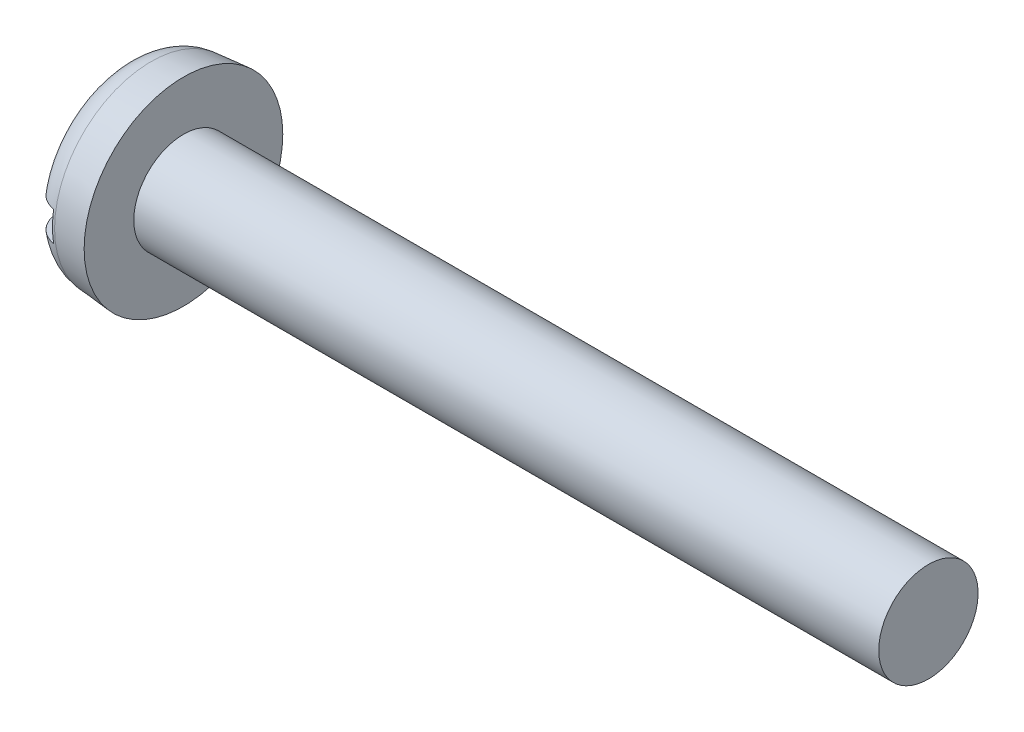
ISO-10303-21;
HEADER;
FILE_DESCRIPTION(('STEP AP214'),'2;1');
FILE_NAME('part.step','',(''),(''),'','','');
FILE_SCHEMA(('AUTOMOTIVE_DESIGN { 1 0 10303 214 1 1 1 1 }'));
ENDSEC;
DATA;
#1=APPLICATION_CONTEXT('core data for automotive mechanical design processes');
#2=APPLICATION_PROTOCOL_DEFINITION('international standard','automotive_design',2000,#1);
#3=PRODUCT_CONTEXT('',#1,'mechanical');
#4=PRODUCT('Part','Part','',(#3));
#5=PRODUCT_RELATED_PRODUCT_CATEGORY('part','',(#4));
#6=PRODUCT_DEFINITION_FORMATION('','',#4);
#7=PRODUCT_DEFINITION_CONTEXT('part definition',#1,'design');
#8=PRODUCT_DEFINITION('design','',#6,#7);
#9=PRODUCT_DEFINITION_SHAPE('','',#8);
#10=(LENGTH_UNIT() NAMED_UNIT(*) SI_UNIT(.MILLI.,.METRE.));
#11=(NAMED_UNIT(*) PLANE_ANGLE_UNIT() SI_UNIT($,.RADIAN.));
#12=(NAMED_UNIT(*) SI_UNIT($,.STERADIAN.) SOLID_ANGLE_UNIT());
#13=UNCERTAINTY_MEASURE_WITH_UNIT(LENGTH_MEASURE(1.E-05),#10,'distance_accuracy_value','');
#14=(GEOMETRIC_REPRESENTATION_CONTEXT(3) GLOBAL_UNCERTAINTY_ASSIGNED_CONTEXT((#13)) GLOBAL_UNIT_ASSIGNED_CONTEXT((#10,
#11,#12)) REPRESENTATION_CONTEXT('',''));
#15=CARTESIAN_POINT('',(0.,0.,0.));
#16=DIRECTION('',(0.,0.,1.));
#17=DIRECTION('',(1.,0.,0.));
#18=AXIS2_PLACEMENT_3D('',#15,#16,#17);
#19=CARTESIAN_POINT('',(0.,0.,0.));
#20=DIRECTION('',(-1.,0.,0.));
#21=DIRECTION('',(0.,0.,1.));
#22=AXIS2_PLACEMENT_3D('',#19,#20,#21);
#23=PLANE('',#22);
#24=DIRECTION('',(0.,0.,-1.));
#25=VECTOR('',#24,1.);
#26=CARTESIAN_POINT('',(0.,0.599999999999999,4.));
#27=LINE('',#26,#25);
#28=CARTESIAN_POINT('',(0.,0.599999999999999,2.62267277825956));
#29=VERTEX_POINT('',#28);
#30=CARTESIAN_POINT('',(0.,0.599999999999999,-2.62267277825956));
#31=VERTEX_POINT('',#30);
#32=EDGE_CURVE('E85',#29,#31,#27,.T.);
#33=ORIENTED_EDGE('',*,*,#32,.F.);
#34=CARTESIAN_POINT('',(0.,0.,0.));
#35=DIRECTION('',(-1.,0.,0.));
#36=DIRECTION('',(0.,0.,1.));
#37=AXIS2_PLACEMENT_3D('',#34,#35,#36);
#38=CIRCLE('',#37,2.69042979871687);
#39=EDGE_CURVE('E91',#29,#31,#38,.T.);
#40=ORIENTED_EDGE('',*,*,#39,.T.);
#41=EDGE_LOOP('',(#33,#40));
#42=FACE_BOUND('',#41,.T.);
#43=ADVANCED_FACE('F32',(#42),#23,.T.);
#44=CARTESIAN_POINT('',(-25.4,0.,0.));
#45=DIRECTION('',(-1.,0.,0.));
#46=DIRECTION('',(0.,0.,1.));
#47=AXIS2_PLACEMENT_3D('',#44,#45,#46);
#48=CYLINDRICAL_SURFACE('',#47,2.);
#49=CARTESIAN_POINT('',(32.4,0.,0.));
#50=DIRECTION('',(-1.,0.,0.));
#51=DIRECTION('',(0.,0.,1.));
#52=AXIS2_PLACEMENT_3D('',#49,#50,#51);
#53=CIRCLE('',#52,2.);
#54=CARTESIAN_POINT('',(32.4,0.,2.));
#55=VERTEX_POINT('',#54);
#56=EDGE_CURVE('E92',#55,#55,#53,.T.);
#57=ORIENTED_EDGE('',*,*,#56,.T.);
#58=EDGE_LOOP('',(#57));
#59=FACE_BOUND('',#58,.T.);
#60=CARTESIAN_POINT('',(2.4,0.,0.));
#61=DIRECTION('',(-1.,0.,0.));
#62=DIRECTION('',(0.,0.,1.));
#63=AXIS2_PLACEMENT_3D('',#60,#61,#62);
#64=CIRCLE('',#63,2.);
#65=CARTESIAN_POINT('',(2.4,0.,2.));
#66=VERTEX_POINT('',#65);
#67=EDGE_CURVE('E149',#66,#66,#64,.T.);
#68=ORIENTED_EDGE('',*,*,#67,.F.);
#69=EDGE_LOOP('',(#68));
#70=FACE_BOUND('',#69,.T.);
#71=ADVANCED_FACE('F137',(#59,#70),#48,.T.);
#72=CARTESIAN_POINT('',(32.4,2.,0.));
#73=DIRECTION('',(1.,0.,0.));
#74=DIRECTION('',(0.,0.,-1.));
#75=AXIS2_PLACEMENT_3D('',#72,#73,#74);
#76=PLANE('',#75);
#77=ORIENTED_EDGE('',*,*,#56,.F.);
#78=EDGE_LOOP('',(#77));
#79=FACE_BOUND('',#78,.T.);
#80=ADVANCED_FACE('F135',(#79),#76,.T.);
#81=DIRECTION('',(0.,0.,1.));
#82=VECTOR('',#81,1.);
#83=CARTESIAN_POINT('',(0.,-0.599999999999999,-4.));
#84=LINE('',#83,#82);
#85=CARTESIAN_POINT('',(0.,-0.6,-2.62267277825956));
#86=VERTEX_POINT('',#85);
#87=CARTESIAN_POINT('',(0.,-0.6,2.62267277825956));
#88=VERTEX_POINT('',#87);
#89=EDGE_CURVE('E76',#86,#88,#84,.T.);
#90=ORIENTED_EDGE('',*,*,#89,.F.);
#91=EDGE_CURVE('E83',#86,#88,#38,.T.);
#92=ORIENTED_EDGE('',*,*,#91,.T.);
#93=EDGE_LOOP('',(#90,#92));
#94=FACE_BOUND('',#93,.T.);
#95=ADVANCED_FACE('F82',(#94),#23,.T.);
#96=CARTESIAN_POINT('',(0.,0.,0.));
#97=DIRECTION('',(1.,0.,0.));
#98=DIRECTION('',(0.,0.,-1.));
#99=AXIS2_PLACEMENT_3D('',#96,#97,#98);
#100=CONICAL_SURFACE('',#99,3.79002720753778,0.0872664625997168);
#101=CARTESIAN_POINT('',(1.09541310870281,0.,0.));
#102=DIRECTION('',(-1.,0.,0.));
#103=DIRECTION('',(0.,0.,1.));
#104=AXIS2_PLACEMENT_3D('',#101,#102,#103);
#105=CIRCLE('',#104,3.88586343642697);
#106=CARTESIAN_POINT('',(1.09541310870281,0.,3.88586343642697));
#107=VERTEX_POINT('',#106);
#108=EDGE_CURVE('E95',#107,#107,#105,.F.);
#109=ORIENTED_EDGE('',*,*,#108,.T.);
#110=EDGE_LOOP('',(#109));
#111=FACE_BOUND('',#110,.T.);
#112=CARTESIAN_POINT('',(2.4,0.,0.));
#113=DIRECTION('',(-1.,0.,0.));
#114=DIRECTION('',(0.,0.,1.));
#115=AXIS2_PLACEMENT_3D('',#112,#113,#114);
#116=CIRCLE('',#115,4.);
#117=CARTESIAN_POINT('',(2.4,0.,4.));
#118=VERTEX_POINT('',#117);
#119=EDGE_CURVE('E97',#118,#118,#116,.T.);
#120=ORIENTED_EDGE('',*,*,#119,.T.);
#121=EDGE_LOOP('',(#120));
#122=FACE_BOUND('',#121,.T.);
#123=ADVANCED_FACE('F128',(#111,#122),#100,.T.);
#124=CARTESIAN_POINT('',(2.4,2.,0.));
#125=DIRECTION('',(-1.,0.,0.));
#126=DIRECTION('',(0.,0.,1.));
#127=AXIS2_PLACEMENT_3D('',#124,#125,#126);
#128=PLANE('',#127);
#129=ORIENTED_EDGE('',*,*,#119,.F.);
#130=EDGE_LOOP('',(#129));
#131=FACE_BOUND('',#130,.T.);
#132=ORIENTED_EDGE('',*,*,#67,.T.);
#133=EDGE_LOOP('',(#132));
#134=FACE_BOUND('',#133,.T.);
#135=ADVANCED_FACE('F124',(#131,#134),#128,.F.);
#136=CARTESIAN_POINT('',(1.2,0.,0.));
#137=DIRECTION('',(-1.,0.,0.));
#138=DIRECTION('',(0.,0.,1.));
#139=AXIS2_PLACEMENT_3D('',#136,#137,#138);
#140=TOROIDAL_SURFACE('',#139,2.69042979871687,1.2);
#141=CARTESIAN_POINT('',(0.3865043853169,0.599999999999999,-3.52185650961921));
#142=CARTESIAN_POINT('',(0.435468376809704,0.599999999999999,-3.56765543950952));
#143=CARTESIAN_POINT('',(0.48830443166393,0.599999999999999,-3.60938194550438));
#144=CARTESIAN_POINT('',(0.600265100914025,0.599999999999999,-3.68342203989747));
#145=CARTESIAN_POINT('',(0.659396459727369,0.599999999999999,-3.71572539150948));
#146=CARTESIAN_POINT('',(0.782252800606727,0.599999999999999,-3.76991557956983));
#147=CARTESIAN_POINT('',(0.845977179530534,0.599999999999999,-3.79180378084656));
#148=CARTESIAN_POINT('',(0.976191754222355,0.599999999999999,-3.82450279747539));
#149=CARTESIAN_POINT('',(1.04268130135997,0.599999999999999,-3.83531619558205));
#150=CARTESIAN_POINT('',(1.1761990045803,0.599999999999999,-3.84552483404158));
#151=CARTESIAN_POINT('',(1.2432228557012,0.599999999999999,-3.84497642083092));
#152=CARTESIAN_POINT('',(1.37622462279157,0.599999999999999,-3.83261582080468));
#153=CARTESIAN_POINT('',(1.44220252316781,0.599999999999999,-3.82080346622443));
#154=CARTESIAN_POINT('',(1.57113854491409,0.599999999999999,-3.7862937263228));
#155=CARTESIAN_POINT('',(1.63410108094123,0.599999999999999,-3.76361282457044));
#156=CARTESIAN_POINT('',(1.75534617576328,0.599999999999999,-3.70804459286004));
#157=CARTESIAN_POINT('',(1.81362870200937,0.599999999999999,-3.67515719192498));
#158=CARTESIAN_POINT('',(1.92413366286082,0.599999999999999,-3.5999836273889));
#159=CARTESIAN_POINT('',(1.97632984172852,0.599999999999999,-3.55765888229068));
#160=CARTESIAN_POINT('',(2.07296076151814,0.599999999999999,-3.46492588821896));
#161=CARTESIAN_POINT('',(2.11739523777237,0.599999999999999,-3.4145173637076));
#162=CARTESIAN_POINT('',(2.19773705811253,0.599999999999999,-3.30652404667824));
#163=CARTESIAN_POINT('',(2.2335546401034,0.599999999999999,-3.24887250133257));
#164=CARTESIAN_POINT('',(2.29517588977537,0.599999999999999,-3.12844912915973));
#165=CARTESIAN_POINT('',(2.32097889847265,0.599999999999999,-3.06567696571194));
#166=CARTESIAN_POINT('',(2.36230436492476,0.599999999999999,-2.93572304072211));
#167=CARTESIAN_POINT('',(2.37765465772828,0.599999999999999,-2.86848656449));
#168=CARTESIAN_POINT('',(2.39710654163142,0.599999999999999,-2.73240889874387));
#169=CARTESIAN_POINT('',(2.40120699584,0.599999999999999,-2.66356754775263));
#170=CARTESIAN_POINT('',(2.39814758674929,0.599999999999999,-2.52464946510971));
#171=CARTESIAN_POINT('',(2.39074269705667,0.599999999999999,-2.45457815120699));
#172=CARTESIAN_POINT('',(2.36454808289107,0.599999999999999,-2.31659764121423));
#173=CARTESIAN_POINT('',(2.34575688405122,0.599999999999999,-2.24868872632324));
#174=CARTESIAN_POINT('',(2.29682890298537,0.599999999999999,-2.11531585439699));
#175=CARTESIAN_POINT('',(2.26644200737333,0.599999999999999,-2.04994358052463));
#176=CARTESIAN_POINT('',(2.19524076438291,0.599999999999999,-1.92513363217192));
#177=CARTESIAN_POINT('',(2.15442449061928,0.599999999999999,-1.86569705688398));
#178=CARTESIAN_POINT('',(2.06294283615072,0.599999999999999,-1.75389115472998));
#179=CARTESIAN_POINT('',(2.01217853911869,0.599999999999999,-1.70160258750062));
#180=CARTESIAN_POINT('',(1.90235992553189,0.599999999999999,-1.60657192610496));
#181=CARTESIAN_POINT('',(1.84330597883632,0.599999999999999,-1.56382940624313));
#182=CARTESIAN_POINT('',(1.72028944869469,0.599999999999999,-1.49071034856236));
#183=CARTESIAN_POINT('',(1.65652070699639,0.599999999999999,-1.46000898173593));
#184=CARTESIAN_POINT('',(1.52445964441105,0.599999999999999,-1.41076217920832));
#185=CARTESIAN_POINT('',(1.45617085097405,0.599999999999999,-1.39220738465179));
#186=CARTESIAN_POINT('',(1.32258878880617,0.599999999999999,-1.3692588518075));
#187=CARTESIAN_POINT('',(1.25746124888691,0.599999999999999,-1.36389765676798));
#188=CARTESIAN_POINT('',(1.12729576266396,0.599999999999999,-1.36480396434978));
#189=CARTESIAN_POINT('',(1.06225779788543,0.599999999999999,-1.37106853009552));
#190=CARTESIAN_POINT('',(0.937361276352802,0.599999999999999,-1.39427975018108));
#191=CARTESIAN_POINT('',(0.877403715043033,0.599999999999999,-1.41070181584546));
#192=CARTESIAN_POINT('',(0.760914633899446,0.599999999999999,-1.45296891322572));
#193=CARTESIAN_POINT('',(0.704383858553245,0.599999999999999,-1.47881598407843));
#194=CARTESIAN_POINT('',(0.59370506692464,0.599999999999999,-1.54020998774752));
#195=CARTESIAN_POINT('',(0.539760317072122,0.599999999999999,-1.57612236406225));
#196=CARTESIAN_POINT('',(0.438104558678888,0.599999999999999,-1.65588570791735));
#197=CARTESIAN_POINT('',(0.390395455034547,0.599999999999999,-1.69973909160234));
#198=CARTESIAN_POINT('',(0.298820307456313,0.599999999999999,-1.79776253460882));
#199=CARTESIAN_POINT('',(0.255521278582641,0.599999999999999,-1.85246315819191));
#200=CARTESIAN_POINT('',(0.178283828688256,0.599999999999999,-1.96812037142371));
#201=CARTESIAN_POINT('',(0.144347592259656,0.599999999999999,-2.02907841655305));
#202=CARTESIAN_POINT('',(0.0855336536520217,0.599999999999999,-2.15824220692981));
#203=CARTESIAN_POINT('',(0.0610804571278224,0.599999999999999,-2.22664188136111));
#204=CARTESIAN_POINT('',(0.0240295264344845,0.599999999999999,-2.36658228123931));
#205=CARTESIAN_POINT('',(0.0114315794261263,0.599999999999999,-2.43812295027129));
#206=CARTESIAN_POINT('',(-0.00140349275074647,0.599999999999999,-2.58214276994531));
#207=CARTESIAN_POINT('',(-0.00166960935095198,0.599999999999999,-2.65461931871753));
#208=CARTESIAN_POINT('',(0.0102529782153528,0.599999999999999,-2.79856484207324));
#209=CARTESIAN_POINT('',(0.0224436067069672,0.599999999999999,-2.87003365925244));
#210=CARTESIAN_POINT('',(0.0586721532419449,0.599999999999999,-3.00828260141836));
#211=CARTESIAN_POINT('',(0.082454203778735,0.599999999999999,-3.07512990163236));
#212=CARTESIAN_POINT('',(0.141152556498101,0.599999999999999,-3.20367573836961));
#213=CARTESIAN_POINT('',(0.176053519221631,0.599999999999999,-3.26538122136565));
#214=CARTESIAN_POINT('',(0.240740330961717,0.599999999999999,-3.35956174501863));
#215=CARTESIAN_POINT('',(0.267410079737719,0.599999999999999,-3.39421743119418));
#216=CARTESIAN_POINT('',(0.324340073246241,0.599999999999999,-3.46044388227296));
#217=CARTESIAN_POINT('',(0.354600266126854,0.599999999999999,-3.49201469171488));
#218=CARTESIAN_POINT('',(0.3865043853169,0.599999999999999,-3.52185650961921));
#219=B_SPLINE_CURVE_WITH_KNOTS('',3,(#141,#142,#143,#144,#145,#146,#147,#148,#149,#150,#151,
#152,#153,#154,#155,#156,#157,#158,#159,#160,#161,#162,#163,#164,#165,#166,#167,#168,#169,#170,
#171,#172,#173,#174,#175,#176,#177,#178,#179,#180,#181,#182,#183,#184,#185,#186,#187,#188,#189,
#190,#191,#192,#193,#194,#195,#196,#197,#198,#199,#200,#201,#202,#203,#204,#205,#206,#207,#208,
#209,#210,#211,#212,#213,#214,#215,#216,#217,#218),.UNSPECIFIED.,.T.,.F.,(4,2,2,2,2,2,2,2,2,2,2,
2,2,2,2,2,2,2,2,2,2,2,2,2,2,2,2,2,2,2,2,2,2,2,2,2,2,2,4),(0.,0.200976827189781,
0.402171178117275,0.603339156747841,0.804460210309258,1.0045840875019,1.2047109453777,
1.40453524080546,1.60436092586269,1.80501901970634,2.00568395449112,2.2083565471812,
2.41104247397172,2.61699090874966,2.82296015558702,3.03337636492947,3.24381982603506,
3.45908552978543,3.67439102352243,3.8919572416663,4.10951375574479,4.32071351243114,
4.53175034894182,4.72677835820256,4.92175710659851,5.10742155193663,5.29312619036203,
5.48672044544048,5.68037370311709,5.88873369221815,6.09714225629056,6.31402614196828,
6.53090613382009,6.74727622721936,6.96367975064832,7.17550906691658,7.38704740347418,
7.51800243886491,7.64895558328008),.UNSPECIFIED.);
#220=CARTESIAN_POINT('',(1.,0.599999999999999,-3.8268957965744));
#221=VERTEX_POINT('',#220);
#222=EDGE_CURVE('E11',#31,#221,#219,.T.);
#223=ORIENTED_EDGE('',*,*,#222,.F.);
#224=ORIENTED_EDGE('',*,*,#39,.F.);
#225=CARTESIAN_POINT('',(0.568676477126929,0.599999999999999,1.55841219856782));
#226=CARTESIAN_POINT('',(0.622454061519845,0.599999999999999,1.52276443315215));
#227=CARTESIAN_POINT('',(0.679085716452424,0.599999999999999,1.49137245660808));
#228=CARTESIAN_POINT('',(0.796770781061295,0.599999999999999,1.43831139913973));
#229=CARTESIAN_POINT('',(0.857825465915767,0.599999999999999,1.41664513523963));
#230=CARTESIAN_POINT('',(0.982921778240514,0.599999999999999,1.38402811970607));
#231=CARTESIAN_POINT('',(1.04697051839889,0.599999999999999,1.37310440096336));
#232=CARTESIAN_POINT('',(1.17597937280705,0.599999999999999,1.36268675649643));
#233=CARTESIAN_POINT('',(1.24093916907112,0.599999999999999,1.36318893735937));
#234=CARTESIAN_POINT('',(1.36722529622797,0.599999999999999,1.37533615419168));
#235=CARTESIAN_POINT('',(1.42859438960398,0.599999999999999,1.38654477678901));
#236=CARTESIAN_POINT('',(1.54865022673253,0.599999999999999,1.41889802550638));
#237=CARTESIAN_POINT('',(1.60733638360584,0.599999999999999,1.44004481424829));
#238=CARTESIAN_POINT('',(1.72180457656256,0.599999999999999,1.49189888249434));
#239=CARTESIAN_POINT('',(1.77749881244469,0.599999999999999,1.52279911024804));
#240=CARTESIAN_POINT('',(1.88340638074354,0.599999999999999,1.59287167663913));
#241=CARTESIAN_POINT('',(1.93361816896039,0.599999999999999,1.63204633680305));
#242=CARTESIAN_POINT('',(2.03113053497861,0.599999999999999,1.7207614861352));
#243=CARTESIAN_POINT('',(2.07792119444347,0.599999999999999,1.77086293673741));
#244=CARTESIAN_POINT('',(2.16295007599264,0.599999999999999,1.87786529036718));
#245=CARTESIAN_POINT('',(2.20118595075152,0.599999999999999,1.93476805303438));
#246=CARTESIAN_POINT('',(2.26997158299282,0.599999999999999,2.05705672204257));
#247=CARTESIAN_POINT('',(2.30000838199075,0.599999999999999,2.12273201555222));
#248=CARTESIAN_POINT('',(2.34872218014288,0.599999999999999,2.25817360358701));
#249=CARTESIAN_POINT('',(2.36739836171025,0.599999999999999,2.32794019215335));
#250=CARTESIAN_POINT('',(2.39284815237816,0.599999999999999,2.47012141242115));
#251=CARTESIAN_POINT('',(2.3995382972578,0.599999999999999,2.54255105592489));
#252=CARTESIAN_POINT('',(2.40041533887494,0.599999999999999,2.68749005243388));
#253=CARTESIAN_POINT('',(2.39460324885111,0.599999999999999,2.75999939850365));
#254=CARTESIAN_POINT('',(2.37072428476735,0.599999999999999,2.90156578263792));
#255=CARTESIAN_POINT('',(2.35289092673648,0.599999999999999,2.97066215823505));
#256=CARTESIAN_POINT('',(2.3055955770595,0.599999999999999,3.10475609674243));
#257=CARTESIAN_POINT('',(2.2761350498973,0.599999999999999,3.16975417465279));
#258=CARTESIAN_POINT('',(2.20718370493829,0.599999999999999,3.29217559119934));
#259=CARTESIAN_POINT('',(2.16794580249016,0.599999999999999,3.34974141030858));
#260=CARTESIAN_POINT('',(2.08018656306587,0.599999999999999,3.45730019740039));
#261=CARTESIAN_POINT('',(2.03166624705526,0.599999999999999,3.50729399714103));
#262=CARTESIAN_POINT('',(1.92773605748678,0.599999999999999,3.59728886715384));
#263=CARTESIAN_POINT('',(1.87247613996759,0.599999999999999,3.63746317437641));
#264=CARTESIAN_POINT('',(1.75592540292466,0.599999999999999,3.70782235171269));
#265=CARTESIAN_POINT('',(1.69463504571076,0.599999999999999,3.73800798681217));
#266=CARTESIAN_POINT('',(1.5686108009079,0.599999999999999,3.78714975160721));
#267=CARTESIAN_POINT('',(1.50393088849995,0.599999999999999,3.80624437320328));
#268=CARTESIAN_POINT('',(1.37227430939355,0.599999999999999,3.83322369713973));
#269=CARTESIAN_POINT('',(1.30529774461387,0.599999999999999,3.84110889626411));
#270=CARTESIAN_POINT('',(1.17141837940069,0.599999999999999,3.845417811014));
#271=CARTESIAN_POINT('',(1.10451797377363,0.599999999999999,3.841916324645));
#272=CARTESIAN_POINT('',(0.972258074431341,0.599999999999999,3.82372114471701));
#273=CARTESIAN_POINT('',(0.906898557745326,0.599999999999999,3.80902761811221));
#274=CARTESIAN_POINT('',(0.779620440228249,0.599999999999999,3.76890152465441));
#275=CARTESIAN_POINT('',(0.717699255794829,0.599999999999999,3.74347714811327));
#276=CARTESIAN_POINT('',(0.598976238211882,0.599999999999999,3.68264222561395));
#277=CARTESIAN_POINT('',(0.542174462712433,0.599999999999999,3.64723156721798));
#278=CARTESIAN_POINT('',(0.434989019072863,0.599999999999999,3.56726339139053));
#279=CARTESIAN_POINT('',(0.384638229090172,0.599999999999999,3.5226618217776));
#280=CARTESIAN_POINT('',(0.292043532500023,0.599999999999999,3.42571932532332));
#281=CARTESIAN_POINT('',(0.249799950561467,0.599999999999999,3.37337808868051));
#282=CARTESIAN_POINT('',(0.174110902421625,0.599999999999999,3.26185326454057));
#283=CARTESIAN_POINT('',(0.140765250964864,0.599999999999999,3.20260196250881));
#284=CARTESIAN_POINT('',(0.0843091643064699,0.599999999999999,3.07941230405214));
#285=CARTESIAN_POINT('',(0.0611994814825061,0.599999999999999,3.01547360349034));
#286=CARTESIAN_POINT('',(0.0254327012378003,0.599999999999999,2.88357716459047));
#287=CARTESIAN_POINT('',(0.0129588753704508,0.599999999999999,2.81556976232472));
#288=CARTESIAN_POINT('',(-0.000658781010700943,0.599999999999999,2.67843562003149));
#289=CARTESIAN_POINT('',(-0.00180186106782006,0.599999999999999,2.60930880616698));
#290=CARTESIAN_POINT('',(0.00723867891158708,0.599999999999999,2.47027110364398));
#291=CARTESIAN_POINT('',(0.0176724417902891,0.599999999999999,2.40037650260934));
#292=CARTESIAN_POINT('',(0.0498636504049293,0.599999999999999,2.2632278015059));
#293=CARTESIAN_POINT('',(0.0716251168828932,0.599999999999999,2.19597464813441));
#294=CARTESIAN_POINT('',(0.126425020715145,0.599999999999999,2.06442921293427));
#295=CARTESIAN_POINT('',(0.159709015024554,0.599999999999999,2.00023925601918));
#296=CARTESIAN_POINT('',(0.236484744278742,0.599999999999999,1.87833288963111));
#297=CARTESIAN_POINT('',(0.279968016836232,0.599999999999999,1.82061117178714));
#298=CARTESIAN_POINT('',(0.363480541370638,0.599999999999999,1.7273106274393));
#299=CARTESIAN_POINT('',(0.401461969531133,0.599999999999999,1.68987927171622));
#300=CARTESIAN_POINT('',(0.481873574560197,0.599999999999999,1.62013708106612));
#301=CARTESIAN_POINT('',(0.524303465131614,0.599999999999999,1.58782591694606));
#302=CARTESIAN_POINT('',(0.568676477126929,0.599999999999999,1.55841219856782));
#303=B_SPLINE_CURVE_WITH_KNOTS('',3,(#225,#226,#227,#228,#229,#230,#231,#232,#233,#234,#235,
#236,#237,#238,#239,#240,#241,#242,#243,#244,#245,#246,#247,#248,#249,#250,#251,#252,#253,#254,
#255,#256,#257,#258,#259,#260,#261,#262,#263,#264,#265,#266,#267,#268,#269,#270,#271,#272,#273,
#274,#275,#276,#277,#278,#279,#280,#281,#282,#283,#284,#285,#286,#287,#288,#289,#290,#291,#292,
#293,#294,#295,#296,#297,#298,#299,#300,#301,#302),.UNSPECIFIED.,.T.,.F.,(4,2,2,2,2,2,2,2,2,2,2,
2,2,2,2,2,2,2,2,2,2,2,2,2,2,2,2,2,2,2,2,2,2,2,2,2,2,2,4),(0.,0.193385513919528,
0.386827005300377,0.580754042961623,0.774615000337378,0.960896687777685,1.14721893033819,
1.33748625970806,1.52780704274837,1.73256769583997,1.93738446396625,2.15302491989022,
2.3686808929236,2.58583282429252,2.80296715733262,3.01600070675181,3.22900743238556,
3.43699107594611,3.64495185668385,3.84892478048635,4.05288207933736,4.25423457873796,
4.45557815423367,4.65560180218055,4.85562246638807,5.05549074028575,5.25536126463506,
5.45621303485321,5.6570728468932,5.86009921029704,6.06314049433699,6.26961358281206,
6.47610034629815,6.68713711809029,6.89824884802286,7.11416888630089,7.3299104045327,
7.4894871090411,7.64905354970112),.UNSPECIFIED.);
#304=CARTESIAN_POINT('',(1.,0.599999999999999,3.8268957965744));
#305=VERTEX_POINT('',#304);
#306=EDGE_CURVE('E109',#305,#29,#303,.T.);
#307=ORIENTED_EDGE('',*,*,#306,.F.);
#308=CARTESIAN_POINT('',(1.,0.,0.));
#309=DIRECTION('',(-1.,0.,0.));
#310=DIRECTION('',(0.,0.,1.));
#311=AXIS2_PLACEMENT_3D('',#308,#309,#310);
#312=CIRCLE('',#311,3.8736457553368);
#313=CARTESIAN_POINT('',(1.,-0.600000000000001,3.8268957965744));
#314=VERTEX_POINT('',#313);
#315=EDGE_CURVE('E103',#305,#314,#312,.F.);
#316=ORIENTED_EDGE('',*,*,#315,.T.);
#317=CARTESIAN_POINT('',(0.568676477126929,-0.6,1.55841219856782));
#318=CARTESIAN_POINT('',(0.509332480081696,-0.6,1.59775463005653));
#319=CARTESIAN_POINT('',(0.453379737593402,-0.6,1.64234041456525));
#320=CARTESIAN_POINT('',(0.349719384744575,-0.6,1.74035526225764));
#321=CARTESIAN_POINT('',(0.302029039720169,-0.6,1.79380239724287));
#322=CARTESIAN_POINT('',(0.216237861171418,-0.6,1.90774469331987));
#323=CARTESIAN_POINT('',(0.178118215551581,-0.6,1.96822568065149));
#324=CARTESIAN_POINT('',(0.112363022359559,-0.6,2.0946004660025));
#325=CARTESIAN_POINT('',(0.0847225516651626,-0.6,2.16049170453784));
#326=CARTESIAN_POINT('',(0.0402688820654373,-0.6,2.29725613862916));
#327=CARTESIAN_POINT('',(0.0236758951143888,-0.6,2.36820113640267));
#328=CARTESIAN_POINT('',(0.00278349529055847,-0.6,2.51189141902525));
#329=CARTESIAN_POINT('',(-0.00151505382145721,-0.6,2.58463683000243));
#330=CARTESIAN_POINT('',(0.00243750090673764,-0.6,2.72894600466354));
#331=CARTESIAN_POINT('',(0.010543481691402,-0.6,2.80051368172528));
#332=CARTESIAN_POINT('',(0.0389520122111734,-0.6,2.94118836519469));
#333=CARTESIAN_POINT('',(0.0592529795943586,-0.6,3.01029568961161));
#334=CARTESIAN_POINT('',(0.110960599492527,-0.6,3.1423581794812));
#335=CARTESIAN_POINT('',(0.142096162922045,-0.6,3.20541948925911));
#336=CARTESIAN_POINT('',(0.214736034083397,-0.6,3.32525905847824));
#337=CARTESIAN_POINT('',(0.256239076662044,-0.6,3.38203808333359));
#338=CARTESIAN_POINT('',(0.347460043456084,-0.6,3.48641848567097));
#339=CARTESIAN_POINT('',(0.396982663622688,-0.6,3.53419059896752));
#340=CARTESIAN_POINT('',(0.503454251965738,-0.6,3.62058393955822));
#341=CARTESIAN_POINT('',(0.560402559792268,-0.600000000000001,3.6592059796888));
#342=CARTESIAN_POINT('',(0.67915616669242,-0.600000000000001,3.72559524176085));
#343=CARTESIAN_POINT('',(0.740873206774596,-0.600000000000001,3.75352040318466));
#344=CARTESIAN_POINT('',(0.868147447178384,-0.600000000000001,3.79850563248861));
#345=CARTESIAN_POINT('',(0.933704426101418,-0.600000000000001,3.81556632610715));
#346=CARTESIAN_POINT('',(1.06616217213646,-0.600000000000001,3.83820251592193));
#347=CARTESIAN_POINT('',(1.13304550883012,-0.600000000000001,3.84388011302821));
#348=CARTESIAN_POINT('',(1.26681198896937,-0.600000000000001,3.84388783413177));
#349=CARTESIAN_POINT('',(1.33369513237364,-0.600000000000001,3.83821825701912));
#350=CARTESIAN_POINT('',(1.46534857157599,-0.600000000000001,3.81573676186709));
#351=CARTESIAN_POINT('',(1.5301247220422,-0.600000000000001,3.79895909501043));
#352=CARTESIAN_POINT('',(1.65595122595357,-0.600000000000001,3.75479405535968));
#353=CARTESIAN_POINT('',(1.7170015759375,-0.600000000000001,3.72740667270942));
#354=CARTESIAN_POINT('',(1.83382644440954,-0.600000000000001,3.66274505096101));
#355=CARTESIAN_POINT('',(1.88958679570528,-0.6,3.62544522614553));
#356=CARTESIAN_POINT('',(1.99411858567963,-0.6,3.54208564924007));
#357=CARTESIAN_POINT('',(2.04288982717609,-0.6,3.49602565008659));
#358=CARTESIAN_POINT('',(2.1325144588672,-0.6,3.39605796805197));
#359=CARTESIAN_POINT('',(2.17329813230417,-0.6,3.34208780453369));
#360=CARTESIAN_POINT('',(2.245373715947,-0.6,3.22814724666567));
#361=CARTESIAN_POINT('',(2.27666509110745,-0.6,3.16817651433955));
#362=CARTESIAN_POINT('',(2.32937247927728,-0.6,3.04302336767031));
#363=CARTESIAN_POINT('',(2.35063955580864,-0.6,2.97777826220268));
#364=CARTESIAN_POINT('',(2.3821555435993,-0.6,2.84468257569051));
#365=CARTESIAN_POINT('',(2.39240345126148,-0.6,2.77683175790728));
#366=CARTESIAN_POINT('',(2.40182781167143,-0.6,2.6389851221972));
#367=CARTESIAN_POINT('',(2.40077563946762,-0.6,2.56897370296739));
#368=CARTESIAN_POINT('',(2.38721389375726,-0.6,2.43007140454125));
#369=CARTESIAN_POINT('',(2.37470291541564,-0.6,2.36118066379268));
#370=CARTESIAN_POINT('',(2.33824897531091,-0.6,2.22476443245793));
#371=CARTESIAN_POINT('',(2.31404566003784,-0.6,2.15730848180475));
#372=CARTESIAN_POINT('',(2.25484108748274,-0.6,2.02730649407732));
#373=CARTESIAN_POINT('',(2.21983804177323,-0.6,1.96476127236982));
#374=CARTESIAN_POINT('',(2.13932874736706,-0.6,1.8453529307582));
#375=CARTESIAN_POINT('',(2.09366234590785,-0.6,1.78859760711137));
#376=CARTESIAN_POINT('',(1.99331431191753,-0.6,1.68367587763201));
#377=CARTESIAN_POINT('',(1.93863170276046,-0.6,1.63551040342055));
#378=CARTESIAN_POINT('',(1.82254625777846,-0.6,1.55016942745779));
#379=CARTESIAN_POINT('',(1.7612597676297,-0.6,1.51283623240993));
#380=CARTESIAN_POINT('',(1.6329601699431,-0.6,1.44984263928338));
#381=CARTESIAN_POINT('',(1.56595104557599,-0.6,1.42417419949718));
#382=CARTESIAN_POINT('',(1.43290073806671,-0.6,1.38720166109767));
#383=CARTESIAN_POINT('',(1.36709528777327,-0.6,1.37505067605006));
#384=CARTESIAN_POINT('',(1.23436273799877,-0.6,1.3628486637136));
#385=CARTESIAN_POINT('',(1.16743586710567,-0.6,1.36279519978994));
#386=CARTESIAN_POINT('',(1.03904581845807,-0.6,1.37438428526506));
#387=CARTESIAN_POINT('',(0.97751125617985,-0.6,1.38526326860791));
#388=CARTESIAN_POINT('',(0.857136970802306,-0.6,1.41700902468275));
#389=CARTESIAN_POINT('',(0.79829431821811,-0.6,1.43786464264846));
#390=CARTESIAN_POINT('',(0.711456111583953,-0.6,1.47666141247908));
#391=CARTESIAN_POINT('',(0.681965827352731,-0.6,1.49136190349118));
#392=CARTESIAN_POINT('',(0.624300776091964,-0.6,1.52313858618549));
#393=CARTESIAN_POINT('',(0.596125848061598,-0.6,1.54021448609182));
#394=CARTESIAN_POINT('',(0.568676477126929,-0.6,1.55841219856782));
#395=B_SPLINE_CURVE_WITH_KNOTS('',3,(#317,#318,#319,#320,#321,#322,#323,#324,#325,#326,#327,
#328,#329,#330,#331,#332,#333,#334,#335,#336,#337,#338,#339,#340,#341,#342,#343,#344,#345,#346,
#347,#348,#349,#350,#351,#352,#353,#354,#355,#356,#357,#358,#359,#360,#361,#362,#363,#364,#365,
#366,#367,#368,#369,#370,#371,#372,#373,#374,#375,#376,#377,#378,#379,#380,#381,#382,#383,#384,
#385,#386,#387,#388,#389,#390,#391,#392,#393,#394),.UNSPECIFIED.,.T.,.F.,(4,2,2,2,2,2,2,2,2,2,2,
2,2,2,2,2,2,2,2,2,2,2,2,2,2,2,2,2,2,2,2,2,2,2,2,2,2,2,4),(0.,0.2134759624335,0.427392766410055,
0.640885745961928,0.854278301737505,1.07180637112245,1.28934972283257,1.50436737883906,
1.71935714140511,1.92931435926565,2.13924596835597,2.34467456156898,2.55008489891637,
2.75233330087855,2.95457005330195,3.15498457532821,3.355393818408,3.55518797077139,
3.75498230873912,3.95529744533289,4.15561823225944,4.35761633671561,4.55962582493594,
4.76454879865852,4.96949043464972,5.17858616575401,5.38770753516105,5.60171647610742,
5.815760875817,6.03325422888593,6.25077115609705,6.46494128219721,6.67896353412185,
6.87865214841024,7.07830054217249,7.26491113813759,7.4513135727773,7.55006829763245,
7.64881090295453),.UNSPECIFIED.);
#396=EDGE_CURVE('E90',#88,#314,#395,.T.);
#397=ORIENTED_EDGE('',*,*,#396,.F.);
#398=ORIENTED_EDGE('',*,*,#91,.F.);
#399=CARTESIAN_POINT('',(0.3865043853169,-0.6,-3.52185650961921));
#400=CARTESIAN_POINT('',(0.336558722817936,-0.6,-3.47513075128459));
#401=CARTESIAN_POINT('',(0.290567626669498,-0.6,-3.42409544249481));
#402=CARTESIAN_POINT('',(0.207816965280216,-0.6,-3.31495007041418));
#403=CARTESIAN_POINT('',(0.171070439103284,-0.6,-3.2568301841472));
#404=CARTESIAN_POINT('',(0.107859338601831,-0.6,-3.13533662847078));
#405=CARTESIAN_POINT('',(0.081381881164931,-0.6,-3.07196966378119));
#406=CARTESIAN_POINT('',(0.0392838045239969,-0.6,-2.94175448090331));
#407=CARTESIAN_POINT('',(0.0236604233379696,-0.6,-2.87490715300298));
#408=CARTESIAN_POINT('',(0.00341113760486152,-0.6,-2.73858284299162));
#409=CARTESIAN_POINT('',(-0.00105268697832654,-0.6,-2.66908182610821));
#410=CARTESIAN_POINT('',(0.00147102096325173,-0.6,-2.53028718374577));
#411=CARTESIAN_POINT('',(0.00846038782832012,-0.6,-2.46099359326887));
#412=CARTESIAN_POINT('',(0.0338721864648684,-0.6,-2.3228723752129));
#413=CARTESIAN_POINT('',(0.052556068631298,-0.6,-2.25409284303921));
#414=CARTESIAN_POINT('',(0.100979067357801,-0.6,-2.12053875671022));
#415=CARTESIAN_POINT('',(0.13071979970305,-0.6,-2.05576478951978));
#416=CARTESIAN_POINT('',(0.201105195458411,-0.6,-1.93075930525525));
#417=CARTESIAN_POINT('',(0.241951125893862,-0.6,-1.87064095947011));
#418=CARTESIAN_POINT('',(0.333200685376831,-0.6,-1.75812796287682));
#419=CARTESIAN_POINT('',(0.383605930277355,-0.6,-1.70573462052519));
#420=CARTESIAN_POINT('',(0.49243046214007,-0.6,-1.61063718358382));
#421=CARTESIAN_POINT('',(0.550808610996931,-0.6,-1.5678861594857));
#422=CARTESIAN_POINT('',(0.674249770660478,-0.6,-1.49345451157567));
#423=CARTESIAN_POINT('',(0.739309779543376,-0.6,-1.46176894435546));
#424=CARTESIAN_POINT('',(0.870462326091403,-0.6,-1.41247032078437));
#425=CARTESIAN_POINT('',(0.936297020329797,-0.6,-1.39417366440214));
#426=CARTESIAN_POINT('',(1.0701878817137,-0.6,-1.36992148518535));
#427=CARTESIAN_POINT('',(1.13824253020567,-0.6,-1.36395769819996));
#428=CARTESIAN_POINT('',(1.26912997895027,-0.6,-1.36469761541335));
#429=CARTESIAN_POINT('',(1.33196990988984,-0.6,-1.37048080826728));
#430=CARTESIAN_POINT('',(1.45576558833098,-0.6,-1.39257493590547));
#431=CARTESIAN_POINT('',(1.51672119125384,-0.6,-1.40888667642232));
#432=CARTESIAN_POINT('',(1.63489640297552,-0.6,-1.45115860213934));
#433=CARTESIAN_POINT('',(1.6921296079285,-0.6,-1.47708105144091));
#434=CARTESIAN_POINT('',(1.80183592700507,-0.6,-1.53754737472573));
#435=CARTESIAN_POINT('',(1.85430778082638,-0.6,-1.57209352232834));
#436=CARTESIAN_POINT('',(1.95690912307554,-0.6,-1.65139148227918));
#437=CARTESIAN_POINT('',(2.00661704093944,-0.6,-1.69668868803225));
#438=CARTESIAN_POINT('',(2.09829662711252,-0.6,-1.79453297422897));
#439=CARTESIAN_POINT('',(2.14026595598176,-0.6,-1.84708223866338));
#440=CARTESIAN_POINT('',(2.21793843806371,-0.6,-1.96160125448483));
#441=CARTESIAN_POINT('',(2.25307298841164,-0.6,-2.02395766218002));
#442=CARTESIAN_POINT('',(2.31259182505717,-0.6,-2.15361082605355));
#443=CARTESIAN_POINT('',(2.33697474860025,-0.6,-2.22090820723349));
#444=CARTESIAN_POINT('',(2.37457912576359,-0.6,-2.35984116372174));
#445=CARTESIAN_POINT('',(2.38759592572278,-0.6,-2.43153235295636));
#446=CARTESIAN_POINT('',(2.40121636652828,-0.6,-2.57608878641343));
#447=CARTESIAN_POINT('',(2.40182066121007,-0.6,-2.64895396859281));
#448=CARTESIAN_POINT('',(2.39052951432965,-0.6,-2.79263451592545));
#449=CARTESIAN_POINT('',(2.37881794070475,-0.6,-2.86346426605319));
#450=CARTESIAN_POINT('',(2.34337531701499,-0.6,-3.00205279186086));
#451=CARTESIAN_POINT('',(2.31964575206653,-0.6,-3.06981194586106));
#452=CARTESIAN_POINT('',(2.26145401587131,-0.6,-3.19862221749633));
#453=CARTESIAN_POINT('',(2.22725936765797,-0.6,-3.25979420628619));
#454=CARTESIAN_POINT('',(2.14887906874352,-0.6,-3.375364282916));
#455=CARTESIAN_POINT('',(2.10469456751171,-0.6,-3.42976314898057));
#456=CARTESIAN_POINT('',(2.00858874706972,-0.6,-3.52906182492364));
#457=CARTESIAN_POINT('',(1.95684621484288,-0.599999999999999,-3.57413473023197));
#458=CARTESIAN_POINT('',(1.84643427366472,-0.599999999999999,-3.65480066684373));
#459=CARTESIAN_POINT('',(1.78776544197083,-0.599999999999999,-3.6903944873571));
#460=CARTESIAN_POINT('',(1.66608419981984,-0.599999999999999,-3.75057174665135));
#461=CARTESIAN_POINT('',(1.60314657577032,-0.599999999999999,-3.77530647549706));
#462=CARTESIAN_POINT('',(1.47399447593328,-0.599999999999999,-3.81375981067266));
#463=CARTESIAN_POINT('',(1.40778030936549,-0.599999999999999,-3.82747945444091));
#464=CARTESIAN_POINT('',(1.27453622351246,-0.599999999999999,-3.84342379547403));
#465=CARTESIAN_POINT('',(1.20751747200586,-0.599999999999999,-3.8457419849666));
#466=CARTESIAN_POINT('',(1.07402733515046,-0.599999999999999,-3.83906549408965));
#467=CARTESIAN_POINT('',(1.00755608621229,-0.599999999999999,-3.83006807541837));
#468=CARTESIAN_POINT('',(0.877192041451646,-0.599999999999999,-3.80105552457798));
#469=CARTESIAN_POINT('',(0.813295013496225,-0.599999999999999,-3.78105934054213));
#470=CARTESIAN_POINT('',(0.68980965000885,-0.599999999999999,-3.73066689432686));
#471=CARTESIAN_POINT('',(0.630215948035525,-0.599999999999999,-3.7002838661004));
#472=CARTESIAN_POINT('',(0.540159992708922,-0.599999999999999,-3.64444320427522));
#473=CARTESIAN_POINT('',(0.507753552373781,-0.6,-3.62205529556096));
#474=CARTESIAN_POINT('',(0.445296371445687,-0.6,-3.57420610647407));
#475=CARTESIAN_POINT('',(0.415245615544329,-0.6,-3.54874484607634));
#476=CARTESIAN_POINT('',(0.3865043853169,-0.6,-3.52185650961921));
#477=B_SPLINE_CURVE_WITH_KNOTS('',3,(#399,#400,#401,#402,#403,#404,#405,#406,#407,#408,#409,
#410,#411,#412,#413,#414,#415,#416,#417,#418,#419,#420,#421,#422,#423,#424,#425,#426,#427,#428,
#429,#430,#431,#432,#433,#434,#435,#436,#437,#438,#439,#440,#441,#442,#443,#444,#445,#446,#447,
#448,#449,#450,#451,#452,#453,#454,#455,#456,#457,#458,#459,#460,#461,#462,#463,#464,#465,#466,
#467,#468,#469,#470,#471,#472,#473,#474,#475,#476),.UNSPECIFIED.,.T.,.F.,(4,2,2,2,2,2,2,2,2,2,2,
2,2,2,2,2,2,2,2,2,2,2,2,2,2,2,2,2,2,2,2,2,2,2,2,2,2,2,4),(0.,0.205037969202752,
0.410363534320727,0.615430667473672,0.82044559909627,1.02842128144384,1.23643027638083,
1.44926442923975,1.66212969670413,1.87914472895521,2.09619647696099,2.31216786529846,
2.52804264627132,2.73193279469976,2.93568627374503,3.12408907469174,3.31250629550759,
3.50019140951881,3.68792605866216,3.88881168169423,4.08975793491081,4.3034897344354,
4.51724861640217,4.73478137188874,4.95230266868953,5.16662200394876,5.38091486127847,
5.59013202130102,5.79932512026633,6.00419443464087,6.20904668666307,6.41094657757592,
6.61282745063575,6.81305010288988,7.01332121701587,7.2132483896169,7.41292177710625,
7.53091163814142,7.64890073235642),.UNSPECIFIED.);
#478=CARTESIAN_POINT('',(1.,-0.599999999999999,-3.8268957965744));
#479=VERTEX_POINT('',#478);
#480=EDGE_CURVE('E44',#479,#86,#477,.T.);
#481=ORIENTED_EDGE('',*,*,#480,.F.);
#482=EDGE_CURVE('E56',#479,#221,#312,.F.);
#483=ORIENTED_EDGE('',*,*,#482,.T.);
#484=EDGE_LOOP('',(#223,#224,#307,#316,#397,#398,#481,#483));
#485=FACE_BOUND('',#484,.T.);
#486=ORIENTED_EDGE('',*,*,#108,.F.);
#487=EDGE_LOOP('',(#486));
#488=FACE_BOUND('',#487,.T.);
#489=ADVANCED_FACE('F34',(#485,#488),#140,.T.);
#490=CARTESIAN_POINT('',(1.,0.599999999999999,4.));
#491=DIRECTION('',(0.,1.,0.));
#492=DIRECTION('',(0.,0.,1.));
#493=AXIS2_PLACEMENT_3D('',#490,#491,#492);
#494=PLANE('',#493);
#495=ORIENTED_EDGE('',*,*,#222,.T.);
#496=DIRECTION('',(0.,0.,-1.));
#497=VECTOR('',#496,1.);
#498=CARTESIAN_POINT('',(1.,0.599999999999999,4.));
#499=LINE('',#498,#497);
#500=EDGE_CURVE('E84',#305,#221,#499,.T.);
#501=ORIENTED_EDGE('',*,*,#500,.F.);
#502=ORIENTED_EDGE('',*,*,#306,.T.);
#503=ORIENTED_EDGE('',*,*,#32,.T.);
#504=EDGE_LOOP('',(#495,#501,#502,#503));
#505=FACE_BOUND('',#504,.T.);
#506=ADVANCED_FACE('F116',(#505),#494,.F.);
#507=CARTESIAN_POINT('',(1.,-0.599999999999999,-4.));
#508=DIRECTION('',(0.,-1.,0.));
#509=DIRECTION('',(0.,0.,-1.));
#510=AXIS2_PLACEMENT_3D('',#507,#508,#509);
#511=PLANE('',#510);
#512=ORIENTED_EDGE('',*,*,#480,.T.);
#513=ORIENTED_EDGE('',*,*,#89,.T.);
#514=ORIENTED_EDGE('',*,*,#396,.T.);
#515=DIRECTION('',(0.,0.,1.));
#516=VECTOR('',#515,1.);
#517=CARTESIAN_POINT('',(1.,-0.599999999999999,-4.));
#518=LINE('',#517,#516);
#519=EDGE_CURVE('E51',#479,#314,#518,.T.);
#520=ORIENTED_EDGE('',*,*,#519,.F.);
#521=EDGE_LOOP('',(#512,#513,#514,#520));
#522=FACE_BOUND('',#521,.T.);
#523=ADVANCED_FACE('F75',(#522),#511,.F.);
#524=CARTESIAN_POINT('',(1.,0.599999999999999,-4.));
#525=DIRECTION('',(-1.,0.,0.));
#526=DIRECTION('',(0.,0.,1.));
#527=AXIS2_PLACEMENT_3D('',#524,#525,#526);
#528=PLANE('',#527);
#529=ORIENTED_EDGE('',*,*,#519,.T.);
#530=ORIENTED_EDGE('',*,*,#315,.F.);
#531=ORIENTED_EDGE('',*,*,#500,.T.);
#532=ORIENTED_EDGE('',*,*,#482,.F.);
#533=EDGE_LOOP('',(#529,#530,#531,#532));
#534=FACE_BOUND('',#533,.T.);
#535=ADVANCED_FACE('F115',(#534),#528,.T.);
#536=CLOSED_SHELL('',(#43,#71,#80,#95,#123,#135,#489,#506,#523,#535));
#537=MANIFOLD_SOLID_BREP('B2',#536);
#538=ADVANCED_BREP_SHAPE_REPRESENTATION('',(#18,#537),#14);
#539=SHAPE_DEFINITION_REPRESENTATION(#9,#538);
ENDSEC;
END-ISO-10303-21;
